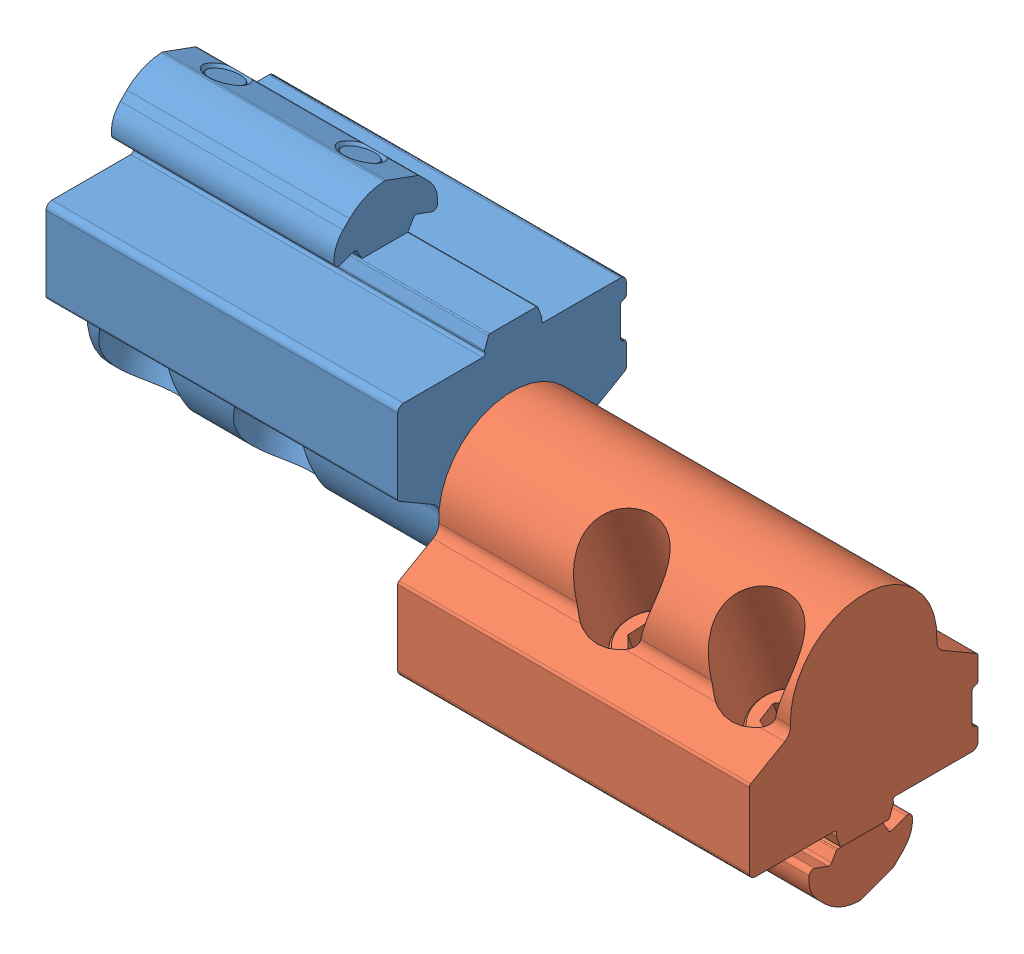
SolidWorks assembly 40mm LH Inline Pivot Kit.SLDASM, configuration Standard (file format 13000). Lengths in mm.
Overall size (120 65.88 39).
2 component instances, 2 part files, 3 mates.
Components (placement in the parent):
- Inline Pivot LH Bushing-1: Inline Pivot LH Bushing.SLDPRT [Default] at origin size (60.85 45.44 39)
- Inline Pivot LH Pin-1: Inline Pivot LH Pin.SLDPRT [Default] at (-0.5 0 0) size (79.05 45.44 39)
Mates (geometry in assembly coordinates):
- Coincident1: coordinate: point of Inline Pivot LH Bushing-1
- Concentric1: concentric anti-aligned: cylinder of Inline Pivot LH Bushing-1 through (0 20 0) axis (1 0 0) radius 4.7625; cylinder of Inline Pivot LH Pin-1 through (-19.55 20 0) axis (-1 0 0) radius 4.7625
- Coincident2: coincident anti-aligned: plane of Inline Pivot LH Bushing-1 through (-0.5 40.4 5) normal (1 0 0); plane of Inline Pivot LH Pin-1 through (-0.5 -0.4 5) normal (-1 0 0)
